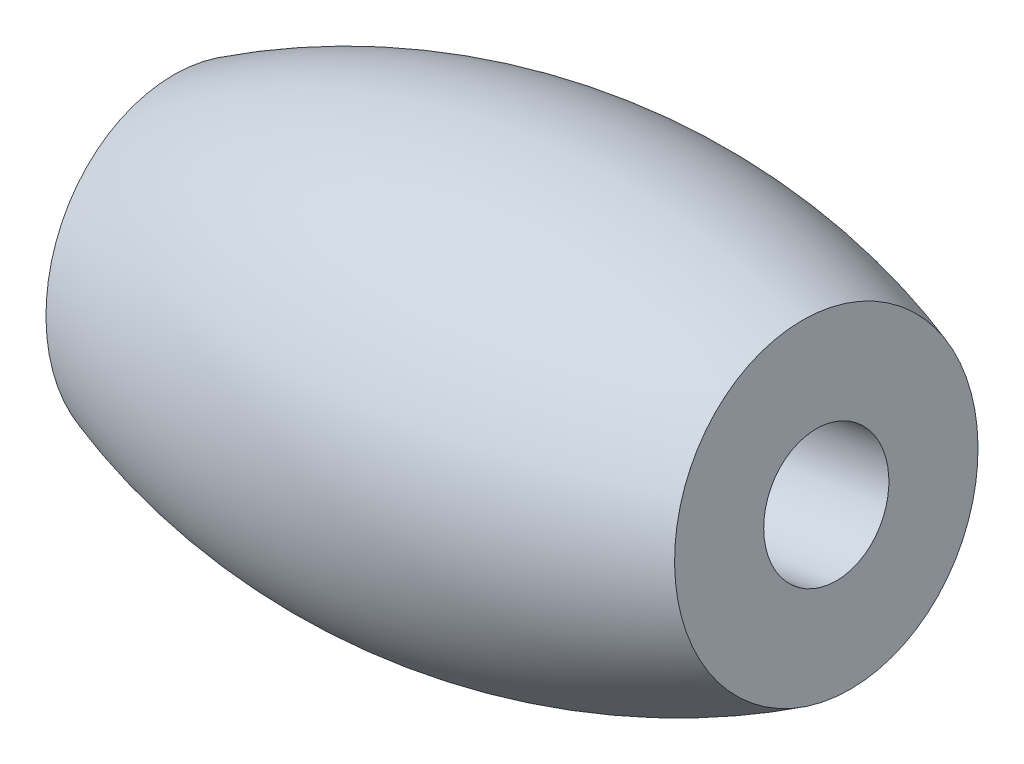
from build123d import *


with BuildPart() as part:
    # Esquisse2 → R_volution1 (revolve)
    with BuildSketch(Plane.XY, mode=Mode.PRIVATE) as r_volution1_sk:
        with BuildLine():
            Line((-21.689749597, 12.562527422), (-22.06504852, 14.882365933))
            ThreePointArc((-22.06504852, 14.882365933), (-13.952464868, 17.960221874), (-5.283238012, 17.597294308))
            Line((-5.283238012, 17.597294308), (-4.90793909, 15.277455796))
            Line((-4.90793909, 15.277455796), (-21.689749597, 12.562527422))
        make_face()
    revolve(r_volution1_sk.sketch.rotate(Axis((-28.353889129, 9.812963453, 0), (0.9871653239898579, 0.15970166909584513, 0)), 180), axis=Axis((-28.353889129, 9.812963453, 0), (0.9871653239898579, 0.15970166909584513, 0)))


solid = part.part
